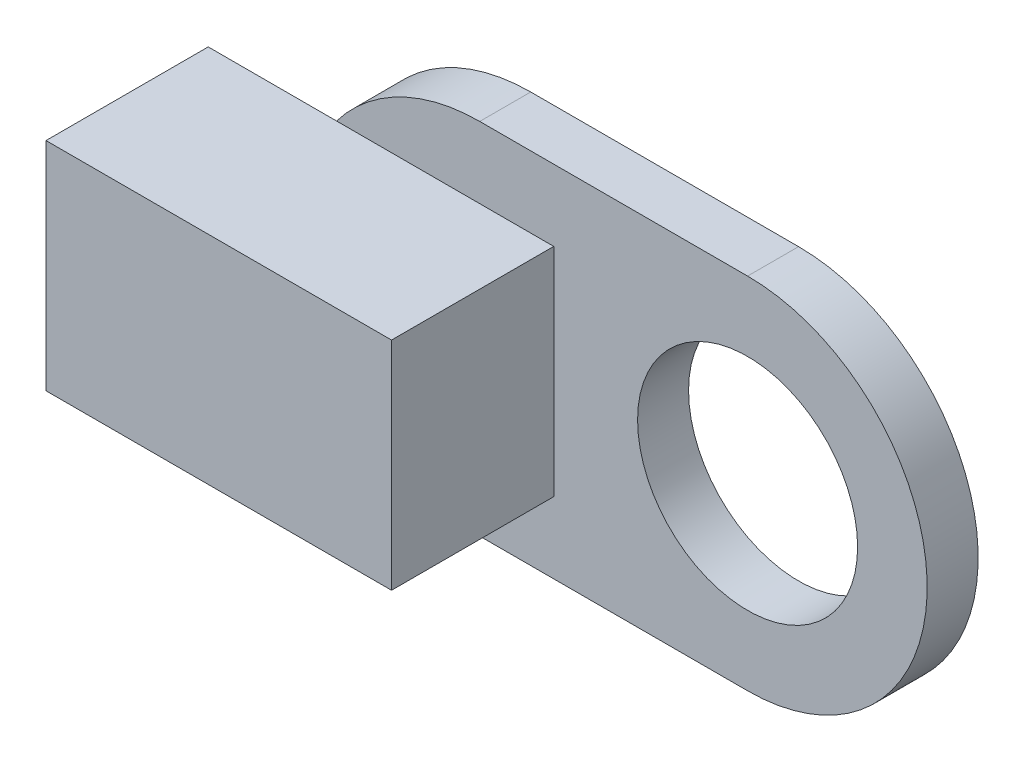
ISO-10303-21;
HEADER;
FILE_DESCRIPTION(('STEP AP214'),'2;1');
FILE_NAME('part.step','',(''),(''),'','','');
FILE_SCHEMA(('AUTOMOTIVE_DESIGN { 1 0 10303 214 1 1 1 1 }'));
ENDSEC;
DATA;
#1=APPLICATION_CONTEXT('core data for automotive mechanical design processes');
#2=APPLICATION_PROTOCOL_DEFINITION('international standard','automotive_design',2000,#1);
#3=PRODUCT_CONTEXT('',#1,'mechanical');
#4=PRODUCT('Part','Part','',(#3));
#5=PRODUCT_RELATED_PRODUCT_CATEGORY('part','',(#4));
#6=PRODUCT_DEFINITION_FORMATION('','',#4);
#7=PRODUCT_DEFINITION_CONTEXT('part definition',#1,'design');
#8=PRODUCT_DEFINITION('design','',#6,#7);
#9=PRODUCT_DEFINITION_SHAPE('','',#8);
#10=(LENGTH_UNIT() NAMED_UNIT(*) SI_UNIT(.MILLI.,.METRE.));
#11=(NAMED_UNIT(*) PLANE_ANGLE_UNIT() SI_UNIT($,.RADIAN.));
#12=(NAMED_UNIT(*) SI_UNIT($,.STERADIAN.) SOLID_ANGLE_UNIT());
#13=UNCERTAINTY_MEASURE_WITH_UNIT(LENGTH_MEASURE(1.E-05),#10,'distance_accuracy_value','');
#14=(GEOMETRIC_REPRESENTATION_CONTEXT(3) GLOBAL_UNCERTAINTY_ASSIGNED_CONTEXT((#13)) GLOBAL_UNIT_ASSIGNED_CONTEXT((#10,
#11,#12)) REPRESENTATION_CONTEXT('',''));
#15=CARTESIAN_POINT('',(0.,0.,0.));
#16=DIRECTION('',(0.,0.,1.));
#17=DIRECTION('',(1.,0.,0.));
#18=AXIS2_PLACEMENT_3D('',#15,#16,#17);
#19=CARTESIAN_POINT('',(-23.1984532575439,0.03285986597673,7.9452));
#20=DIRECTION('',(0.,0.,1.));
#21=DIRECTION('',(1.,0.,0.));
#22=AXIS2_PLACEMENT_3D('',#19,#20,#21);
#23=PLANE('',#22);
#24=DIRECTION('',(0.,1.,0.));
#25=VECTOR('',#24,1.);
#26=CARTESIAN_POINT('',(-29.6373532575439,-4.00574013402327,7.9452));
#27=LINE('',#26,#25);
#28=CARTESIAN_POINT('',(-29.6373532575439,-4.00574013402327,7.9452));
#29=VERTEX_POINT('',#28);
#30=CARTESIAN_POINT('',(-29.6373532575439,4.07145986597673,7.9452));
#31=VERTEX_POINT('',#30);
#32=EDGE_CURVE('E97',#29,#31,#27,.T.);
#33=ORIENTED_EDGE('',*,*,#32,.F.);
#34=DIRECTION('',(1.,0.,0.));
#35=VECTOR('',#34,1.);
#36=CARTESIAN_POINT('',(-16.7595532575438,-4.00574013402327,7.9452));
#37=LINE('',#36,#35);
#38=CARTESIAN_POINT('',(-16.7595532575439,-4.00574013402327,7.9452));
#39=VERTEX_POINT('',#38);
#40=EDGE_CURVE('E103',#39,#29,#37,.F.);
#41=ORIENTED_EDGE('',*,*,#40,.F.);
#42=DIRECTION('',(0.,1.,0.));
#43=VECTOR('',#42,1.);
#44=CARTESIAN_POINT('',(-16.7595532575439,4.07145986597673,7.9452));
#45=LINE('',#44,#43);
#46=CARTESIAN_POINT('',(-16.7595532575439,4.07145986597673,7.9452));
#47=VERTEX_POINT('',#46);
#48=EDGE_CURVE('E129',#47,#39,#45,.F.);
#49=ORIENTED_EDGE('',*,*,#48,.F.);
#50=DIRECTION('',(1.,0.,0.));
#51=VECTOR('',#50,1.);
#52=CARTESIAN_POINT('',(-29.6373532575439,4.07145986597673,7.9452));
#53=LINE('',#52,#51);
#54=EDGE_CURVE('E114',#31,#47,#53,.T.);
#55=ORIENTED_EDGE('',*,*,#54,.F.);
#56=EDGE_LOOP('',(#33,#41,#49,#55));
#57=FACE_BOUND('',#56,.T.);
#58=ADVANCED_FACE('F15',(#57),#23,.T.);
#59=CARTESIAN_POINT('',(-29.6373532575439,-4.00574013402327,1.9));
#60=DIRECTION('',(-1.,0.,0.));
#61=DIRECTION('',(0.,0.,1.));
#62=AXIS2_PLACEMENT_3D('',#59,#60,#61);
#63=PLANE('',#62);
#64=DIRECTION('',(0.,1.,0.));
#65=VECTOR('',#64,1.);
#66=CARTESIAN_POINT('',(-29.6373532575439,0.03285986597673,1.9));
#67=LINE('',#66,#65);
#68=CARTESIAN_POINT('',(-29.6373532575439,4.07145986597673,1.9));
#69=VERTEX_POINT('',#68);
#70=CARTESIAN_POINT('',(-29.6373532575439,-4.00574013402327,1.9));
#71=VERTEX_POINT('',#70);
#72=EDGE_CURVE('E119',#69,#71,#67,.F.);
#73=ORIENTED_EDGE('',*,*,#72,.T.);
#74=DIRECTION('',(0.,0.,-1.));
#75=VECTOR('',#74,1.);
#76=CARTESIAN_POINT('',(-29.6373532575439,-4.00574013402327,1.9));
#77=LINE('',#76,#75);
#78=EDGE_CURVE('E107',#29,#71,#77,.T.);
#79=ORIENTED_EDGE('',*,*,#78,.F.);
#80=ORIENTED_EDGE('',*,*,#32,.T.);
#81=DIRECTION('',(0.,0.,1.));
#82=VECTOR('',#81,1.);
#83=CARTESIAN_POINT('',(-29.6373532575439,4.07145986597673,1.9));
#84=LINE('',#83,#82);
#85=EDGE_CURVE('E121',#69,#31,#84,.T.);
#86=ORIENTED_EDGE('',*,*,#85,.F.);
#87=EDGE_LOOP('',(#73,#79,#80,#86));
#88=FACE_BOUND('',#87,.T.);
#89=ADVANCED_FACE('F117',(#88),#63,.T.);
#90=CARTESIAN_POINT('',(-16.7595532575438,-4.00574013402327,1.9));
#91=DIRECTION('',(0.,-1.,0.));
#92=DIRECTION('',(0.,0.,-1.));
#93=AXIS2_PLACEMENT_3D('',#90,#91,#92);
#94=PLANE('',#93);
#95=DIRECTION('',(1.,0.,0.));
#96=VECTOR('',#95,1.);
#97=CARTESIAN_POINT('',(-14.5264532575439,-4.00574013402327,1.9));
#98=LINE('',#97,#96);
#99=CARTESIAN_POINT('',(-16.7595532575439,-4.00574013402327,1.9));
#100=VERTEX_POINT('',#99);
#101=CARTESIAN_POINT('',(-24.8546517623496,-4.00574013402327,1.9));
#102=VERTEX_POINT('',#101);
#103=EDGE_CURVE('E163',#100,#102,#98,.F.);
#104=ORIENTED_EDGE('',*,*,#103,.F.);
#105=DIRECTION('',(0.,0.,-1.));
#106=VECTOR('',#105,1.);
#107=CARTESIAN_POINT('',(-16.7595532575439,-4.00574013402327,1.9));
#108=LINE('',#107,#106);
#109=EDGE_CURVE('E109',#39,#100,#108,.T.);
#110=ORIENTED_EDGE('',*,*,#109,.F.);
#111=ORIENTED_EDGE('',*,*,#40,.T.);
#112=ORIENTED_EDGE('',*,*,#78,.T.);
#113=DIRECTION('',(1.,0.,0.));
#114=VECTOR('',#113,1.);
#115=CARTESIAN_POINT('',(-23.1984532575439,-4.00574013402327,1.9));
#116=LINE('',#115,#114);
#117=EDGE_CURVE('E127',#71,#102,#116,.T.);
#118=ORIENTED_EDGE('',*,*,#117,.T.);
#119=EDGE_LOOP('',(#104,#110,#111,#112,#118));
#120=FACE_BOUND('',#119,.T.);
#121=ADVANCED_FACE('F105',(#120),#94,.T.);
#122=CARTESIAN_POINT('',(-29.6373532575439,4.07145986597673,1.9));
#123=DIRECTION('',(0.,1.,0.));
#124=DIRECTION('',(0.,0.,1.));
#125=AXIS2_PLACEMENT_3D('',#122,#123,#124);
#126=PLANE('',#125);
#127=DIRECTION('',(1.,0.,0.));
#128=VECTOR('',#127,1.);
#129=CARTESIAN_POINT('',(-23.1984532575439,4.07145986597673,1.9));
#130=LINE('',#129,#128);
#131=CARTESIAN_POINT('',(-24.8546517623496,4.07145986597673,1.9));
#132=VERTEX_POINT('',#131);
#133=EDGE_CURVE('E128',#132,#69,#130,.F.);
#134=ORIENTED_EDGE('',*,*,#133,.T.);
#135=ORIENTED_EDGE('',*,*,#85,.T.);
#136=ORIENTED_EDGE('',*,*,#54,.T.);
#137=DIRECTION('',(0.,0.,-1.));
#138=VECTOR('',#137,1.);
#139=CARTESIAN_POINT('',(-16.7595532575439,4.07145986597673,1.9));
#140=LINE('',#139,#138);
#141=CARTESIAN_POINT('',(-16.7595532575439,4.07145986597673,1.9));
#142=VERTEX_POINT('',#141);
#143=EDGE_CURVE('E170',#142,#47,#140,.F.);
#144=ORIENTED_EDGE('',*,*,#143,.F.);
#145=DIRECTION('',(1.,0.,0.));
#146=VECTOR('',#145,1.);
#147=CARTESIAN_POINT('',(-14.5264532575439,4.07145986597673,1.9));
#148=LINE('',#147,#146);
#149=EDGE_CURVE('E76',#132,#142,#148,.T.);
#150=ORIENTED_EDGE('',*,*,#149,.F.);
#151=EDGE_LOOP('',(#134,#135,#136,#144,#150));
#152=FACE_BOUND('',#151,.T.);
#153=ADVANCED_FACE('F180',(#152),#126,.T.);
#154=CARTESIAN_POINT('',(-16.7595532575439,4.07145986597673,1.9));
#155=DIRECTION('',(1.,0.,0.));
#156=DIRECTION('',(0.,0.,-1.));
#157=AXIS2_PLACEMENT_3D('',#154,#155,#156);
#158=PLANE('',#157);
#159=DIRECTION('',(0.,1.,0.));
#160=VECTOR('',#159,1.);
#161=CARTESIAN_POINT('',(-16.7595532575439,0.032859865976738,1.9));
#162=LINE('',#161,#160);
#163=EDGE_CURVE('E162',#142,#100,#162,.F.);
#164=ORIENTED_EDGE('',*,*,#163,.F.);
#165=ORIENTED_EDGE('',*,*,#143,.T.);
#166=ORIENTED_EDGE('',*,*,#48,.T.);
#167=ORIENTED_EDGE('',*,*,#109,.T.);
#168=EDGE_LOOP('',(#164,#165,#166,#167));
#169=FACE_BOUND('',#168,.T.);
#170=ADVANCED_FACE('F251',(#169),#158,.T.);
#171=CARTESIAN_POINT('',(-23.1984532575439,0.03285986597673,1.9));
#172=DIRECTION('',(0.,0.,1.));
#173=DIRECTION('',(1.,0.,0.));
#174=AXIS2_PLACEMENT_3D('',#171,#172,#173);
#175=PLANE('',#174);
#176=ORIENTED_EDGE('',*,*,#117,.F.);
#177=ORIENTED_EDGE('',*,*,#72,.F.);
#178=ORIENTED_EDGE('',*,*,#133,.F.);
#179=CARTESIAN_POINT('',(-19.5175532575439,0.032859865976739,1.9));
#180=DIRECTION('',(0.,0.,1.));
#181=DIRECTION('',(1.,0.,0.));
#182=AXIS2_PLACEMENT_3D('',#179,#180,#181);
#183=CIRCLE('',#182,6.6929);
#184=EDGE_CURVE('E145',#102,#132,#183,.F.);
#185=ORIENTED_EDGE('',*,*,#184,.F.);
#186=EDGE_LOOP('',(#176,#177,#178,#185));
#187=FACE_BOUND('',#186,.T.);
#188=ADVANCED_FACE('F177',(#187),#175,.F.);
#189=CARTESIAN_POINT('',(-14.5264532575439,0.032859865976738,1.9));
#190=DIRECTION('',(0.,0.,1.));
#191=DIRECTION('',(1.,0.,0.));
#192=AXIS2_PLACEMENT_3D('',#189,#190,#191);
#193=PLANE('',#192);
#194=CARTESIAN_POINT('',(-9.53535325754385,0.032859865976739,1.9));
#195=DIRECTION('',(0.,0.,1.));
#196=DIRECTION('',(1.,0.,0.));
#197=AXIS2_PLACEMENT_3D('',#194,#195,#196);
#198=CIRCLE('',#197,4.1);
#199=CARTESIAN_POINT('',(-5.43535325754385,0.032859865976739,1.9));
#200=VERTEX_POINT('',#199);
#201=EDGE_CURVE('E138',#200,#200,#198,.F.);
#202=ORIENTED_EDGE('',*,*,#201,.T.);
#203=EDGE_LOOP('',(#202));
#204=FACE_BOUND('',#203,.T.);
#205=ORIENTED_EDGE('',*,*,#149,.T.);
#206=ORIENTED_EDGE('',*,*,#163,.T.);
#207=ORIENTED_EDGE('',*,*,#103,.T.);
#208=CARTESIAN_POINT('',(-19.5175532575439,0.032859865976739,1.9));
#209=DIRECTION('',(0.,0.,1.));
#210=DIRECTION('',(1.,0.,0.));
#211=AXIS2_PLACEMENT_3D('',#208,#209,#210);
#212=CIRCLE('',#211,6.6929);
#213=CARTESIAN_POINT('',(-19.5175532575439,-6.66004013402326,1.9));
#214=VERTEX_POINT('',#213);
#215=EDGE_CURVE('E147',#214,#102,#212,.F.);
#216=ORIENTED_EDGE('',*,*,#215,.F.);
#217=DIRECTION('',(1.,0.,0.));
#218=VECTOR('',#217,1.);
#219=CARTESIAN_POINT('',(-9.53535325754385,-6.66004013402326,1.9));
#220=LINE('',#219,#218);
#221=CARTESIAN_POINT('',(-9.53535325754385,-6.66004013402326,1.9));
#222=VERTEX_POINT('',#221);
#223=EDGE_CURVE('E165',#222,#214,#220,.F.);
#224=ORIENTED_EDGE('',*,*,#223,.F.);
#225=CARTESIAN_POINT('',(-9.53535325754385,0.032859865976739,1.9));
#226=DIRECTION('',(0.,0.,1.));
#227=DIRECTION('',(1.,0.,0.));
#228=AXIS2_PLACEMENT_3D('',#225,#226,#227);
#229=CIRCLE('',#228,6.6929);
#230=CARTESIAN_POINT('',(-9.53535325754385,6.72575986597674,1.9));
#231=VERTEX_POINT('',#230);
#232=EDGE_CURVE('E18',#231,#222,#229,.F.);
#233=ORIENTED_EDGE('',*,*,#232,.F.);
#234=DIRECTION('',(1.,0.,0.));
#235=VECTOR('',#234,1.);
#236=CARTESIAN_POINT('',(-19.5175532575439,6.72575986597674,1.9));
#237=LINE('',#236,#235);
#238=CARTESIAN_POINT('',(-19.5175532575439,6.72575986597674,1.9));
#239=VERTEX_POINT('',#238);
#240=EDGE_CURVE('E62',#239,#231,#237,.T.);
#241=ORIENTED_EDGE('',*,*,#240,.F.);
#242=CARTESIAN_POINT('',(-19.5175532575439,0.032859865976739,1.9));
#243=DIRECTION('',(0.,0.,1.));
#244=DIRECTION('',(1.,0.,0.));
#245=AXIS2_PLACEMENT_3D('',#242,#243,#244);
#246=CIRCLE('',#245,6.6929);
#247=EDGE_CURVE('E143',#132,#239,#246,.F.);
#248=ORIENTED_EDGE('',*,*,#247,.F.);
#249=EDGE_LOOP('',(#205,#206,#207,#216,#224,#233,#241,#248));
#250=FACE_BOUND('',#249,.T.);
#251=ADVANCED_FACE('F173',(#204,#250),#193,.T.);
#252=CARTESIAN_POINT('',(-9.53535325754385,-6.66004013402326,0.));
#253=DIRECTION('',(0.,-1.,0.));
#254=DIRECTION('',(0.,0.,-1.));
#255=AXIS2_PLACEMENT_3D('',#252,#253,#254);
#256=PLANE('',#255);
#257=DIRECTION('',(1.,0.,0.));
#258=VECTOR('',#257,1.);
#259=CARTESIAN_POINT('',(-14.5264532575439,-6.66004013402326,0.));
#260=LINE('',#259,#258);
#261=CARTESIAN_POINT('',(-19.5175532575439,-6.66004013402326,0.));
#262=VERTEX_POINT('',#261);
#263=CARTESIAN_POINT('',(-9.53535325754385,-6.66004013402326,0.));
#264=VERTEX_POINT('',#263);
#265=EDGE_CURVE('E137',#262,#264,#260,.T.);
#266=ORIENTED_EDGE('',*,*,#265,.T.);
#267=DIRECTION('',(0.,0.,1.));
#268=VECTOR('',#267,1.);
#269=CARTESIAN_POINT('',(-9.53535325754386,-6.66004013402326,0.));
#270=LINE('',#269,#268);
#271=EDGE_CURVE('E155',#222,#264,#270,.F.);
#272=ORIENTED_EDGE('',*,*,#271,.F.);
#273=ORIENTED_EDGE('',*,*,#223,.T.);
#274=DIRECTION('',(0.,0.,1.));
#275=VECTOR('',#274,1.);
#276=CARTESIAN_POINT('',(-19.5175532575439,-6.66004013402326,0.));
#277=LINE('',#276,#275);
#278=EDGE_CURVE('E142',#262,#214,#277,.T.);
#279=ORIENTED_EDGE('',*,*,#278,.F.);
#280=EDGE_LOOP('',(#266,#272,#273,#279));
#281=FACE_BOUND('',#280,.T.);
#282=ADVANCED_FACE('F188',(#281),#256,.T.);
#283=CARTESIAN_POINT('',(-9.53535325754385,0.032859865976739,0.));
#284=DIRECTION('',(0.,0.,1.));
#285=DIRECTION('',(1.,0.,0.));
#286=AXIS2_PLACEMENT_3D('',#283,#284,#285);
#287=CYLINDRICAL_SURFACE('',#286,6.6929);
#288=CARTESIAN_POINT('',(-9.53535325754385,0.032859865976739,0.));
#289=DIRECTION('',(0.,0.,1.));
#290=DIRECTION('',(1.,0.,0.));
#291=AXIS2_PLACEMENT_3D('',#288,#289,#290);
#292=CIRCLE('',#291,6.6929);
#293=CARTESIAN_POINT('',(-9.53535325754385,6.72575986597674,0.));
#294=VERTEX_POINT('',#293);
#295=EDGE_CURVE('E134',#264,#294,#292,.T.);
#296=ORIENTED_EDGE('',*,*,#295,.T.);
#297=DIRECTION('',(0.,0.,1.));
#298=VECTOR('',#297,1.);
#299=CARTESIAN_POINT('',(-9.53535325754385,6.72575986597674,0.));
#300=LINE('',#299,#298);
#301=EDGE_CURVE('E149',#231,#294,#300,.F.);
#302=ORIENTED_EDGE('',*,*,#301,.F.);
#303=ORIENTED_EDGE('',*,*,#232,.T.);
#304=ORIENTED_EDGE('',*,*,#271,.T.);
#305=EDGE_LOOP('',(#296,#302,#303,#304));
#306=FACE_BOUND('',#305,.T.);
#307=ADVANCED_FACE('F192',(#306),#287,.T.);
#308=CARTESIAN_POINT('',(-19.5175532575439,6.72575986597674,0.));
#309=DIRECTION('',(0.,1.,0.));
#310=DIRECTION('',(0.,0.,1.));
#311=AXIS2_PLACEMENT_3D('',#308,#309,#310);
#312=PLANE('',#311);
#313=DIRECTION('',(1.,0.,0.));
#314=VECTOR('',#313,1.);
#315=CARTESIAN_POINT('',(-14.5264532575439,6.72575986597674,0.));
#316=LINE('',#315,#314);
#317=CARTESIAN_POINT('',(-19.5175532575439,6.72575986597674,0.));
#318=VERTEX_POINT('',#317);
#319=EDGE_CURVE('E133',#294,#318,#316,.F.);
#320=ORIENTED_EDGE('',*,*,#319,.T.);
#321=DIRECTION('',(0.,0.,1.));
#322=VECTOR('',#321,1.);
#323=CARTESIAN_POINT('',(-19.5175532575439,6.72575986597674,0.));
#324=LINE('',#323,#322);
#325=EDGE_CURVE('E34',#239,#318,#324,.F.);
#326=ORIENTED_EDGE('',*,*,#325,.F.);
#327=ORIENTED_EDGE('',*,*,#240,.T.);
#328=ORIENTED_EDGE('',*,*,#301,.T.);
#329=EDGE_LOOP('',(#320,#326,#327,#328));
#330=FACE_BOUND('',#329,.T.);
#331=ADVANCED_FACE('F181',(#330),#312,.T.);
#332=CARTESIAN_POINT('',(-19.5175532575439,0.032859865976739,0.));
#333=DIRECTION('',(0.,0.,1.));
#334=DIRECTION('',(1.,0.,0.));
#335=AXIS2_PLACEMENT_3D('',#332,#333,#334);
#336=CYLINDRICAL_SURFACE('',#335,6.6929);
#337=CARTESIAN_POINT('',(-19.5175532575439,0.032859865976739,0.));
#338=DIRECTION('',(0.,0.,1.));
#339=DIRECTION('',(1.,0.,0.));
#340=AXIS2_PLACEMENT_3D('',#337,#338,#339);
#341=CIRCLE('',#340,6.6929);
#342=EDGE_CURVE('E25',#318,#262,#341,.T.);
#343=ORIENTED_EDGE('',*,*,#342,.T.);
#344=ORIENTED_EDGE('',*,*,#278,.T.);
#345=ORIENTED_EDGE('',*,*,#215,.T.);
#346=ORIENTED_EDGE('',*,*,#184,.T.);
#347=ORIENTED_EDGE('',*,*,#247,.T.);
#348=ORIENTED_EDGE('',*,*,#325,.T.);
#349=EDGE_LOOP('',(#343,#344,#345,#346,#347,#348));
#350=FACE_BOUND('',#349,.T.);
#351=ADVANCED_FACE('F178',(#350),#336,.T.);
#352=CARTESIAN_POINT('',(-9.53535325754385,0.032859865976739,0.));
#353=DIRECTION('',(0.,0.,1.));
#354=DIRECTION('',(1.,0.,0.));
#355=AXIS2_PLACEMENT_3D('',#352,#353,#354);
#356=CYLINDRICAL_SURFACE('',#355,4.1);
#357=CARTESIAN_POINT('',(-9.53535325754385,0.032859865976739,0.));
#358=DIRECTION('',(0.,0.,1.));
#359=DIRECTION('',(1.,0.,0.));
#360=AXIS2_PLACEMENT_3D('',#357,#358,#359);
#361=CIRCLE('',#360,4.1);
#362=CARTESIAN_POINT('',(-5.43535325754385,0.032859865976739,0.));
#363=VERTEX_POINT('',#362);
#364=EDGE_CURVE('E10',#363,#363,#361,.F.);
#365=ORIENTED_EDGE('',*,*,#364,.T.);
#366=EDGE_LOOP('',(#365));
#367=FACE_BOUND('',#366,.T.);
#368=ORIENTED_EDGE('',*,*,#201,.F.);
#369=EDGE_LOOP('',(#368));
#370=FACE_BOUND('',#369,.T.);
#371=ADVANCED_FACE('F203',(#367,#370),#356,.F.);
#372=CARTESIAN_POINT('',(-14.5264532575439,0.032859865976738,0.));
#373=DIRECTION('',(0.,0.,1.));
#374=DIRECTION('',(1.,0.,0.));
#375=AXIS2_PLACEMENT_3D('',#372,#373,#374);
#376=PLANE('',#375);
#377=ORIENTED_EDGE('',*,*,#364,.F.);
#378=EDGE_LOOP('',(#377));
#379=FACE_BOUND('',#378,.T.);
#380=ORIENTED_EDGE('',*,*,#319,.F.);
#381=ORIENTED_EDGE('',*,*,#295,.F.);
#382=ORIENTED_EDGE('',*,*,#265,.F.);
#383=ORIENTED_EDGE('',*,*,#342,.F.);
#384=EDGE_LOOP('',(#380,#381,#382,#383));
#385=FACE_BOUND('',#384,.T.);
#386=ADVANCED_FACE('F191',(#379,#385),#376,.F.);
#387=CLOSED_SHELL('',(#58,#89,#121,#153,#170,#188,#251,#282,#307,#331,#351,#371,#386));
#388=MANIFOLD_SOLID_BREP('B1',#387);
#389=ADVANCED_BREP_SHAPE_REPRESENTATION('',(#18,#388),#14);
#390=SHAPE_DEFINITION_REPRESENTATION(#9,#389);
ENDSEC;
END-ISO-10303-21;
